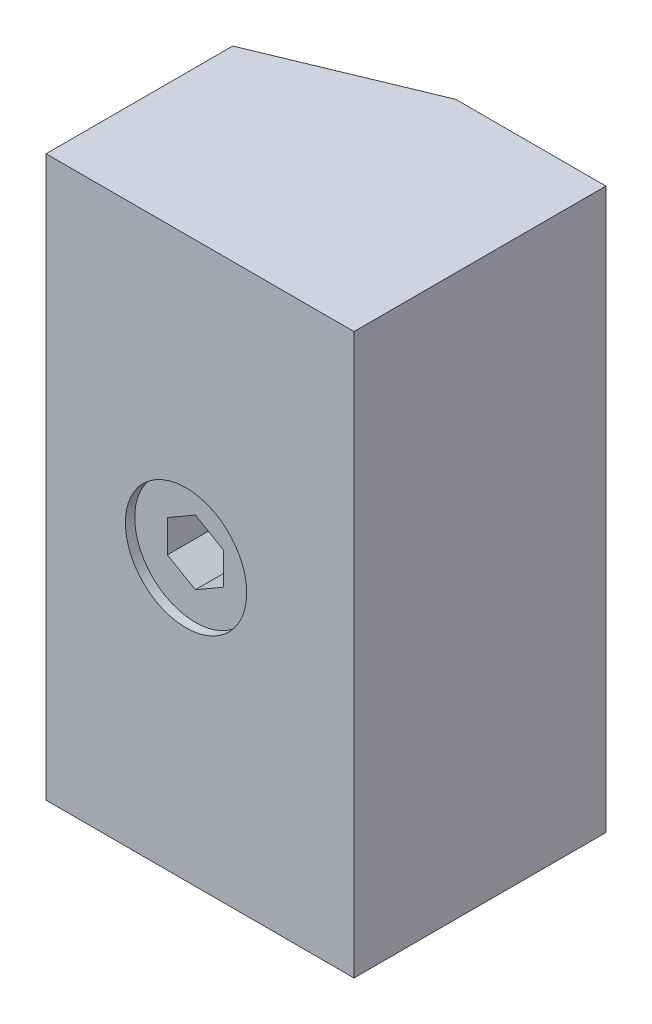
ISO-10303-21;
HEADER;
FILE_DESCRIPTION(('STEP AP214'),'2;1');
FILE_NAME('part.step','',(''),(''),'','','');
FILE_SCHEMA(('AUTOMOTIVE_DESIGN { 1 0 10303 214 1 1 1 1 }'));
ENDSEC;
DATA;
#1=APPLICATION_CONTEXT('core data for automotive mechanical design processes');
#2=APPLICATION_PROTOCOL_DEFINITION('international standard','automotive_design',2000,#1);
#3=PRODUCT_CONTEXT('',#1,'mechanical');
#4=PRODUCT('Part','Part','',(#3));
#5=PRODUCT_RELATED_PRODUCT_CATEGORY('part','',(#4));
#6=PRODUCT_DEFINITION_FORMATION('','',#4);
#7=PRODUCT_DEFINITION_CONTEXT('part definition',#1,'design');
#8=PRODUCT_DEFINITION('design','',#6,#7);
#9=PRODUCT_DEFINITION_SHAPE('','',#8);
#10=(LENGTH_UNIT() NAMED_UNIT(*) SI_UNIT(.MILLI.,.METRE.));
#11=(NAMED_UNIT(*) PLANE_ANGLE_UNIT() SI_UNIT($,.RADIAN.));
#12=(NAMED_UNIT(*) SI_UNIT($,.STERADIAN.) SOLID_ANGLE_UNIT());
#13=UNCERTAINTY_MEASURE_WITH_UNIT(LENGTH_MEASURE(1.E-05),#10,'distance_accuracy_value','');
#14=(GEOMETRIC_REPRESENTATION_CONTEXT(3) GLOBAL_UNCERTAINTY_ASSIGNED_CONTEXT((#13)) GLOBAL_UNIT_ASSIGNED_CONTEXT((#10,
#11,#12)) REPRESENTATION_CONTEXT('',''));
#15=CARTESIAN_POINT('',(0.,0.,0.));
#16=DIRECTION('',(0.,0.,1.));
#17=DIRECTION('',(1.,0.,0.));
#18=AXIS2_PLACEMENT_3D('',#15,#16,#17);
#19=CARTESIAN_POINT('',(-33.,-72.6380112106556,27.));
#20=DIRECTION('',(-1.,0.,0.));
#21=DIRECTION('',(0.,-1.,0.));
#22=AXIS2_PLACEMENT_3D('',#19,#20,#21);
#23=PLANE('',#22);
#24=DIRECTION('',(0.,0.,-1.));
#25=VECTOR('',#24,1.);
#26=CARTESIAN_POINT('',(-33.,-30.,27.));
#27=LINE('',#26,#25);
#28=CARTESIAN_POINT('',(-33.,-30.,27.));
#29=VERTEX_POINT('',#28);
#30=CARTESIAN_POINT('',(-33.,-30.,7.));
#31=VERTEX_POINT('',#30);
#32=EDGE_CURVE('E46',#29,#31,#27,.T.);
#33=ORIENTED_EDGE('',*,*,#32,.F.);
#34=DIRECTION('',(0.,1.,0.));
#35=VECTOR('',#34,1.);
#36=CARTESIAN_POINT('',(-33.,-72.6380112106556,27.));
#37=LINE('',#36,#35);
#38=CARTESIAN_POINT('',(-33.,30.,27.));
#39=VERTEX_POINT('',#38);
#40=EDGE_CURVE('E185',#29,#39,#37,.T.);
#41=ORIENTED_EDGE('',*,*,#40,.T.);
#42=DIRECTION('',(0.,0.,1.));
#43=VECTOR('',#42,1.);
#44=CARTESIAN_POINT('',(-33.,30.,27.));
#45=LINE('',#44,#43);
#46=CARTESIAN_POINT('',(-33.,30.,7.));
#47=VERTEX_POINT('',#46);
#48=EDGE_CURVE('E164',#47,#39,#45,.T.);
#49=ORIENTED_EDGE('',*,*,#48,.F.);
#50=DIRECTION('',(0.,1.,0.));
#51=VECTOR('',#50,1.);
#52=CARTESIAN_POINT('',(-33.,-72.6380112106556,7.));
#53=LINE('',#52,#51);
#54=EDGE_CURVE('E57',#31,#47,#53,.T.);
#55=ORIENTED_EDGE('',*,*,#54,.F.);
#56=EDGE_LOOP('',(#33,#41,#49,#55));
#57=FACE_BOUND('',#56,.T.);
#58=ADVANCED_FACE('F14',(#57),#23,.T.);
#59=CARTESIAN_POINT('',(-33.,-72.6380112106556,7.));
#60=DIRECTION('',(-0.382683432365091,0.,-0.923879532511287));
#61=DIRECTION('',(-0.923879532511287,0.,0.382683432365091));
#62=AXIS2_PLACEMENT_3D('',#59,#60,#61);
#63=PLANE('',#62);
#64=DIRECTION('',(0.923879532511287,0.,-0.382683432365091));
#65=VECTOR('',#64,1.);
#66=CARTESIAN_POINT('',(-33.,-30.,7.));
#67=LINE('',#66,#65);
#68=CARTESIAN_POINT('',(-16.1005050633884,-30.,0.));
#69=VERTEX_POINT('',#68);
#70=EDGE_CURVE('E168',#31,#69,#67,.T.);
#71=ORIENTED_EDGE('',*,*,#70,.F.);
#72=ORIENTED_EDGE('',*,*,#54,.T.);
#73=DIRECTION('',(-0.923879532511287,0.,0.382683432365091));
#74=VECTOR('',#73,1.);
#75=CARTESIAN_POINT('',(-33.,30.,7.));
#76=LINE('',#75,#74);
#77=CARTESIAN_POINT('',(-16.1005050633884,30.,0.));
#78=VERTEX_POINT('',#77);
#79=EDGE_CURVE('E182',#78,#47,#76,.T.);
#80=ORIENTED_EDGE('',*,*,#79,.F.);
#81=DIRECTION('',(0.,1.,0.));
#82=VECTOR('',#81,1.);
#83=CARTESIAN_POINT('',(-16.1005050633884,-72.6380112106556,0.));
#84=LINE('',#83,#82);
#85=EDGE_CURVE('E187',#69,#78,#84,.T.);
#86=ORIENTED_EDGE('',*,*,#85,.F.);
#87=EDGE_LOOP('',(#71,#72,#80,#86));
#88=FACE_BOUND('',#87,.T.);
#89=ADVANCED_FACE('F203',(#88),#63,.T.);
#90=CARTESIAN_POINT('',(0.,-72.6380112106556,0.));
#91=DIRECTION('',(0.,0.,-1.));
#92=DIRECTION('',(-1.,0.,0.));
#93=AXIS2_PLACEMENT_3D('',#90,#91,#92);
#94=PLANE('',#93);
#95=DIRECTION('',(1.,0.,0.));
#96=VECTOR('',#95,1.);
#97=CARTESIAN_POINT('',(0.,-30.,0.));
#98=LINE('',#97,#96);
#99=CARTESIAN_POINT('',(0.,-30.,0.));
#100=VERTEX_POINT('',#99);
#101=EDGE_CURVE('E166',#69,#100,#98,.T.);
#102=ORIENTED_EDGE('',*,*,#101,.F.);
#103=ORIENTED_EDGE('',*,*,#85,.T.);
#104=DIRECTION('',(-1.,0.,0.));
#105=VECTOR('',#104,1.);
#106=CARTESIAN_POINT('',(0.,30.,0.));
#107=LINE('',#106,#105);
#108=CARTESIAN_POINT('',(0.,30.,0.));
#109=VERTEX_POINT('',#108);
#110=EDGE_CURVE('E179',#109,#78,#107,.T.);
#111=ORIENTED_EDGE('',*,*,#110,.F.);
#112=DIRECTION('',(0.,1.,0.));
#113=VECTOR('',#112,1.);
#114=CARTESIAN_POINT('',(0.,-72.6380112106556,0.));
#115=LINE('',#114,#113);
#116=EDGE_CURVE('E189',#100,#109,#115,.T.);
#117=ORIENTED_EDGE('',*,*,#116,.F.);
#118=EDGE_LOOP('',(#102,#103,#111,#117));
#119=FACE_BOUND('',#118,.T.);
#120=ADVANCED_FACE('F206',(#119),#94,.T.);
#121=CARTESIAN_POINT('',(0.,-72.6380112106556,27.));
#122=DIRECTION('',(1.,0.,0.));
#123=DIRECTION('',(0.,1.,0.));
#124=AXIS2_PLACEMENT_3D('',#121,#122,#123);
#125=PLANE('',#124);
#126=DIRECTION('',(0.,0.,1.));
#127=VECTOR('',#126,1.);
#128=CARTESIAN_POINT('',(0.,-30.,27.));
#129=LINE('',#128,#127);
#130=CARTESIAN_POINT('',(0.,-30.,27.));
#131=VERTEX_POINT('',#130);
#132=EDGE_CURVE('E50',#100,#131,#129,.T.);
#133=ORIENTED_EDGE('',*,*,#132,.F.);
#134=ORIENTED_EDGE('',*,*,#116,.T.);
#135=DIRECTION('',(0.,0.,-1.));
#136=VECTOR('',#135,1.);
#137=CARTESIAN_POINT('',(0.,30.,27.));
#138=LINE('',#137,#136);
#139=CARTESIAN_POINT('',(0.,30.,27.));
#140=VERTEX_POINT('',#139);
#141=EDGE_CURVE('E176',#140,#109,#138,.T.);
#142=ORIENTED_EDGE('',*,*,#141,.F.);
#143=DIRECTION('',(0.,1.,0.));
#144=VECTOR('',#143,1.);
#145=CARTESIAN_POINT('',(0.,-72.6380112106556,27.));
#146=LINE('',#145,#144);
#147=EDGE_CURVE('E191',#131,#140,#146,.T.);
#148=ORIENTED_EDGE('',*,*,#147,.F.);
#149=EDGE_LOOP('',(#133,#134,#142,#148));
#150=FACE_BOUND('',#149,.T.);
#151=ADVANCED_FACE('F210',(#150),#125,.T.);
#152=CARTESIAN_POINT('',(-33.,-72.6380112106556,27.));
#153=DIRECTION('',(0.,0.,1.));
#154=DIRECTION('',(1.,0.,0.));
#155=AXIS2_PLACEMENT_3D('',#152,#153,#154);
#156=PLANE('',#155);
#157=CARTESIAN_POINT('',(-18.,0.,27.));
#158=DIRECTION('',(0.,0.,1.));
#159=DIRECTION('',(1.,0.,0.));
#160=AXIS2_PLACEMENT_3D('',#157,#158,#159);
#161=CIRCLE('',#160,6.5);
#162=CARTESIAN_POINT('',(-11.5,0.,27.));
#163=VERTEX_POINT('',#162);
#164=EDGE_CURVE('E140',#163,#163,#161,.T.);
#165=ORIENTED_EDGE('',*,*,#164,.F.);
#166=EDGE_LOOP('',(#165));
#167=FACE_BOUND('',#166,.T.);
#168=DIRECTION('',(-1.,0.,0.));
#169=VECTOR('',#168,1.);
#170=CARTESIAN_POINT('',(-33.,-30.,27.));
#171=LINE('',#170,#169);
#172=EDGE_CURVE('E21',#131,#29,#171,.T.);
#173=ORIENTED_EDGE('',*,*,#172,.F.);
#174=ORIENTED_EDGE('',*,*,#147,.T.);
#175=DIRECTION('',(1.,0.,0.));
#176=VECTOR('',#175,1.);
#177=CARTESIAN_POINT('',(-33.,30.,27.));
#178=LINE('',#177,#176);
#179=EDGE_CURVE('E173',#39,#140,#178,.T.);
#180=ORIENTED_EDGE('',*,*,#179,.F.);
#181=ORIENTED_EDGE('',*,*,#40,.F.);
#182=EDGE_LOOP('',(#173,#174,#180,#181));
#183=FACE_BOUND('',#182,.T.);
#184=ADVANCED_FACE('F197',(#167,#183),#156,.T.);
#185=CARTESIAN_POINT('',(-33.,30.,27.));
#186=DIRECTION('',(0.,-1.,0.));
#187=DIRECTION('',(1.,0.,0.));
#188=AXIS2_PLACEMENT_3D('',#185,#186,#187);
#189=PLANE('',#188);
#190=ORIENTED_EDGE('',*,*,#48,.T.);
#191=ORIENTED_EDGE('',*,*,#179,.T.);
#192=ORIENTED_EDGE('',*,*,#141,.T.);
#193=ORIENTED_EDGE('',*,*,#110,.T.);
#194=ORIENTED_EDGE('',*,*,#79,.T.);
#195=EDGE_LOOP('',(#190,#191,#192,#193,#194));
#196=FACE_BOUND('',#195,.T.);
#197=ADVANCED_FACE('F200',(#196),#189,.F.);
#198=CARTESIAN_POINT('',(-2.,-30.,-13.));
#199=DIRECTION('',(0.,1.,0.));
#200=DIRECTION('',(-1.,0.,0.));
#201=AXIS2_PLACEMENT_3D('',#198,#199,#200);
#202=PLANE('',#201);
#203=ORIENTED_EDGE('',*,*,#32,.T.);
#204=ORIENTED_EDGE('',*,*,#70,.T.);
#205=ORIENTED_EDGE('',*,*,#101,.T.);
#206=ORIENTED_EDGE('',*,*,#132,.T.);
#207=ORIENTED_EDGE('',*,*,#172,.T.);
#208=EDGE_LOOP('',(#203,#204,#205,#206,#207));
#209=FACE_BOUND('',#208,.T.);
#210=ADVANCED_FACE('F208',(#209),#202,.F.);
#211=CARTESIAN_POINT('',(-18.,0.,26.));
#212=DIRECTION('',(0.,0.,1.));
#213=DIRECTION('',(1.,0.,0.));
#214=AXIS2_PLACEMENT_3D('',#211,#212,#213);
#215=CYLINDRICAL_SURFACE('',#214,6.5);
#216=CARTESIAN_POINT('',(-18.,0.,26.));
#217=DIRECTION('',(0.,0.,1.));
#218=DIRECTION('',(1.,0.,0.));
#219=AXIS2_PLACEMENT_3D('',#216,#217,#218);
#220=CIRCLE('',#219,6.5);
#221=CARTESIAN_POINT('',(-11.5,0.,26.));
#222=VERTEX_POINT('',#221);
#223=EDGE_CURVE('E141',#222,#222,#220,.T.);
#224=ORIENTED_EDGE('',*,*,#223,.F.);
#225=EDGE_LOOP('',(#224));
#226=FACE_BOUND('',#225,.T.);
#227=ORIENTED_EDGE('',*,*,#164,.T.);
#228=EDGE_LOOP('',(#227));
#229=FACE_BOUND('',#228,.T.);
#230=ADVANCED_FACE('F235',(#226,#229),#215,.F.);
#231=CARTESIAN_POINT('',(-18.,0.,26.));
#232=DIRECTION('',(0.,0.,1.));
#233=DIRECTION('',(1.,0.,0.));
#234=AXIS2_PLACEMENT_3D('',#231,#232,#233);
#235=PLANE('',#234);
#236=DIRECTION('',(-0.866025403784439,-0.5,0.));
#237=VECTOR('',#236,1.);
#238=CARTESIAN_POINT('',(-18.,3.46410161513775,26.));
#239=LINE('',#238,#237);
#240=CARTESIAN_POINT('',(-18.,3.46410161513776,26.));
#241=VERTEX_POINT('',#240);
#242=CARTESIAN_POINT('',(-21.,1.73205080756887,26.));
#243=VERTEX_POINT('',#242);
#244=EDGE_CURVE('E112',#241,#243,#239,.T.);
#245=ORIENTED_EDGE('',*,*,#244,.F.);
#246=DIRECTION('',(-0.866025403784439,0.5,0.));
#247=VECTOR('',#246,1.);
#248=CARTESIAN_POINT('',(-15.,1.73205080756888,26.));
#249=LINE('',#248,#247);
#250=CARTESIAN_POINT('',(-15.,1.73205080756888,26.));
#251=VERTEX_POINT('',#250);
#252=EDGE_CURVE('E150',#251,#241,#249,.T.);
#253=ORIENTED_EDGE('',*,*,#252,.F.);
#254=DIRECTION('',(0.,1.,0.));
#255=VECTOR('',#254,1.);
#256=CARTESIAN_POINT('',(-15.,-1.73205080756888,26.));
#257=LINE('',#256,#255);
#258=CARTESIAN_POINT('',(-15.,-1.73205080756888,26.));
#259=VERTEX_POINT('',#258);
#260=EDGE_CURVE('E147',#259,#251,#257,.T.);
#261=ORIENTED_EDGE('',*,*,#260,.F.);
#262=DIRECTION('',(0.866025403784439,0.5,0.));
#263=VECTOR('',#262,1.);
#264=CARTESIAN_POINT('',(-18.,-3.46410161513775,26.));
#265=LINE('',#264,#263);
#266=CARTESIAN_POINT('',(-18.,-3.46410161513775,26.));
#267=VERTEX_POINT('',#266);
#268=EDGE_CURVE('E28',#267,#259,#265,.T.);
#269=ORIENTED_EDGE('',*,*,#268,.F.);
#270=DIRECTION('',(0.866025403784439,-0.5,0.));
#271=VECTOR('',#270,1.);
#272=CARTESIAN_POINT('',(-21.,-1.73205080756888,26.));
#273=LINE('',#272,#271);
#274=CARTESIAN_POINT('',(-21.,-1.73205080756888,26.));
#275=VERTEX_POINT('',#274);
#276=EDGE_CURVE('E9',#275,#267,#273,.T.);
#277=ORIENTED_EDGE('',*,*,#276,.F.);
#278=DIRECTION('',(0.,-1.,0.));
#279=VECTOR('',#278,1.);
#280=CARTESIAN_POINT('',(-21.,1.73205080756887,26.));
#281=LINE('',#280,#279);
#282=EDGE_CURVE('E154',#243,#275,#281,.T.);
#283=ORIENTED_EDGE('',*,*,#282,.F.);
#284=EDGE_LOOP('',(#245,#253,#261,#269,#277,#283));
#285=FACE_BOUND('',#284,.T.);
#286=ORIENTED_EDGE('',*,*,#223,.T.);
#287=EDGE_LOOP('',(#286));
#288=FACE_BOUND('',#287,.T.);
#289=ADVANCED_FACE('F240',(#285,#288),#235,.T.);
#290=CARTESIAN_POINT('',(-21.,-1.73205080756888,45.9694030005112));
#291=DIRECTION('',(0.5,0.866025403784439,0.));
#292=DIRECTION('',(-0.866025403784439,0.5,0.));
#293=AXIS2_PLACEMENT_3D('',#290,#291,#292);
#294=PLANE('',#293);
#295=DIRECTION('',(0.,0.,-1.));
#296=VECTOR('',#295,1.);
#297=CARTESIAN_POINT('',(-21.,-1.73205080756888,45.9694030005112));
#298=LINE('',#297,#296);
#299=CARTESIAN_POINT('',(-21.,-1.73205080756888,20.4));
#300=VERTEX_POINT('',#299);
#301=EDGE_CURVE('E116',#275,#300,#298,.T.);
#302=ORIENTED_EDGE('',*,*,#301,.F.);
#303=ORIENTED_EDGE('',*,*,#276,.T.);
#304=DIRECTION('',(0.,0.,-1.));
#305=VECTOR('',#304,1.);
#306=CARTESIAN_POINT('',(-18.,-3.46410161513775,45.9694030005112));
#307=LINE('',#306,#305);
#308=CARTESIAN_POINT('',(-18.,-3.46410161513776,20.4));
#309=VERTEX_POINT('',#308);
#310=EDGE_CURVE('E162',#267,#309,#307,.T.);
#311=ORIENTED_EDGE('',*,*,#310,.T.);
#312=DIRECTION('',(0.866025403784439,-0.5,0.));
#313=VECTOR('',#312,1.);
#314=CARTESIAN_POINT('',(-21.,-1.73205080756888,20.4));
#315=LINE('',#314,#313);
#316=EDGE_CURVE('E125',#300,#309,#315,.T.);
#317=ORIENTED_EDGE('',*,*,#316,.F.);
#318=EDGE_LOOP('',(#302,#303,#311,#317));
#319=FACE_BOUND('',#318,.T.);
#320=ADVANCED_FACE('F236',(#319),#294,.T.);
#321=CARTESIAN_POINT('',(-18.,-3.46410161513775,45.9694030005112));
#322=DIRECTION('',(-0.5,0.866025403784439,0.));
#323=DIRECTION('',(-0.866025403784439,-0.5,0.));
#324=AXIS2_PLACEMENT_3D('',#321,#322,#323);
#325=PLANE('',#324);
#326=ORIENTED_EDGE('',*,*,#310,.F.);
#327=ORIENTED_EDGE('',*,*,#268,.T.);
#328=DIRECTION('',(0.,0.,-1.));
#329=VECTOR('',#328,1.);
#330=CARTESIAN_POINT('',(-15.,-1.73205080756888,45.9694030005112));
#331=LINE('',#330,#329);
#332=CARTESIAN_POINT('',(-15.,-1.73205080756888,20.4));
#333=VERTEX_POINT('',#332);
#334=EDGE_CURVE('E160',#259,#333,#331,.T.);
#335=ORIENTED_EDGE('',*,*,#334,.T.);
#336=DIRECTION('',(0.866025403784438,0.5,0.));
#337=VECTOR('',#336,1.);
#338=CARTESIAN_POINT('',(-18.,-3.46410161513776,20.4));
#339=LINE('',#338,#337);
#340=EDGE_CURVE('E134',#309,#333,#339,.T.);
#341=ORIENTED_EDGE('',*,*,#340,.F.);
#342=EDGE_LOOP('',(#326,#327,#335,#341));
#343=FACE_BOUND('',#342,.T.);
#344=ADVANCED_FACE('F239',(#343),#325,.T.);
#345=CARTESIAN_POINT('',(-15.,-1.73205080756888,45.9694030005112));
#346=DIRECTION('',(-1.,0.,0.));
#347=DIRECTION('',(0.,0.,1.));
#348=AXIS2_PLACEMENT_3D('',#345,#346,#347);
#349=PLANE('',#348);
#350=ORIENTED_EDGE('',*,*,#334,.F.);
#351=ORIENTED_EDGE('',*,*,#260,.T.);
#352=DIRECTION('',(0.,0.,-1.));
#353=VECTOR('',#352,1.);
#354=CARTESIAN_POINT('',(-15.,1.73205080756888,45.9694030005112));
#355=LINE('',#354,#353);
#356=CARTESIAN_POINT('',(-15.,1.73205080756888,20.4));
#357=VERTEX_POINT('',#356);
#358=EDGE_CURVE('E158',#251,#357,#355,.T.);
#359=ORIENTED_EDGE('',*,*,#358,.T.);
#360=DIRECTION('',(0.,1.,0.));
#361=VECTOR('',#360,1.);
#362=CARTESIAN_POINT('',(-15.,-1.73205080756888,20.4));
#363=LINE('',#362,#361);
#364=EDGE_CURVE('E137',#333,#357,#363,.T.);
#365=ORIENTED_EDGE('',*,*,#364,.F.);
#366=EDGE_LOOP('',(#350,#351,#359,#365));
#367=FACE_BOUND('',#366,.T.);
#368=ADVANCED_FACE('F244',(#367),#349,.T.);
#369=CARTESIAN_POINT('',(-15.,1.73205080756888,45.9694030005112));
#370=DIRECTION('',(-0.5,-0.866025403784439,0.));
#371=DIRECTION('',(0.866025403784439,-0.5,0.));
#372=AXIS2_PLACEMENT_3D('',#369,#370,#371);
#373=PLANE('',#372);
#374=ORIENTED_EDGE('',*,*,#358,.F.);
#375=ORIENTED_EDGE('',*,*,#252,.T.);
#376=DIRECTION('',(0.,0.,-1.));
#377=VECTOR('',#376,1.);
#378=CARTESIAN_POINT('',(-18.,3.46410161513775,45.9694030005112));
#379=LINE('',#378,#377);
#380=CARTESIAN_POINT('',(-18.,3.46410161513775,20.4));
#381=VERTEX_POINT('',#380);
#382=EDGE_CURVE('E115',#241,#381,#379,.T.);
#383=ORIENTED_EDGE('',*,*,#382,.T.);
#384=DIRECTION('',(-0.866025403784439,0.5,0.));
#385=VECTOR('',#384,1.);
#386=CARTESIAN_POINT('',(-15.,1.73205080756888,20.4));
#387=LINE('',#386,#385);
#388=EDGE_CURVE('E130',#357,#381,#387,.T.);
#389=ORIENTED_EDGE('',*,*,#388,.F.);
#390=EDGE_LOOP('',(#374,#375,#383,#389));
#391=FACE_BOUND('',#390,.T.);
#392=ADVANCED_FACE('F248',(#391),#373,.T.);
#393=CARTESIAN_POINT('',(-18.,3.46410161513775,45.9694030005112));
#394=DIRECTION('',(0.5,-0.866025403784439,0.));
#395=DIRECTION('',(0.866025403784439,0.5,0.));
#396=AXIS2_PLACEMENT_3D('',#393,#394,#395);
#397=PLANE('',#396);
#398=ORIENTED_EDGE('',*,*,#382,.F.);
#399=ORIENTED_EDGE('',*,*,#244,.T.);
#400=DIRECTION('',(0.,0.,-1.));
#401=VECTOR('',#400,1.);
#402=CARTESIAN_POINT('',(-21.,1.73205080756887,45.9694030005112));
#403=LINE('',#402,#401);
#404=CARTESIAN_POINT('',(-21.,1.73205080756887,20.4));
#405=VERTEX_POINT('',#404);
#406=EDGE_CURVE('E105',#243,#405,#403,.T.);
#407=ORIENTED_EDGE('',*,*,#406,.T.);
#408=DIRECTION('',(-0.866025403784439,-0.5,0.));
#409=VECTOR('',#408,1.);
#410=CARTESIAN_POINT('',(-18.,3.46410161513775,20.4));
#411=LINE('',#410,#409);
#412=EDGE_CURVE('E110',#381,#405,#411,.T.);
#413=ORIENTED_EDGE('',*,*,#412,.F.);
#414=EDGE_LOOP('',(#398,#399,#407,#413));
#415=FACE_BOUND('',#414,.T.);
#416=ADVANCED_FACE('F108',(#415),#397,.T.);
#417=CARTESIAN_POINT('',(-21.,1.73205080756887,45.9694030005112));
#418=DIRECTION('',(1.,0.,0.));
#419=DIRECTION('',(0.,0.,-1.));
#420=AXIS2_PLACEMENT_3D('',#417,#418,#419);
#421=PLANE('',#420);
#422=ORIENTED_EDGE('',*,*,#406,.F.);
#423=ORIENTED_EDGE('',*,*,#282,.T.);
#424=ORIENTED_EDGE('',*,*,#301,.T.);
#425=DIRECTION('',(0.,-1.,0.));
#426=VECTOR('',#425,1.);
#427=CARTESIAN_POINT('',(-21.,1.73205080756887,20.4));
#428=LINE('',#427,#426);
#429=EDGE_CURVE('E119',#405,#300,#428,.T.);
#430=ORIENTED_EDGE('',*,*,#429,.F.);
#431=EDGE_LOOP('',(#422,#423,#424,#430));
#432=FACE_BOUND('',#431,.T.);
#433=ADVANCED_FACE('F120',(#432),#421,.T.);
#434=CARTESIAN_POINT('',(0.,0.,20.4));
#435=DIRECTION('',(0.,0.,1.));
#436=DIRECTION('',(1.,0.,0.));
#437=AXIS2_PLACEMENT_3D('',#434,#435,#436);
#438=PLANE('',#437);
#439=ORIENTED_EDGE('',*,*,#412,.T.);
#440=ORIENTED_EDGE('',*,*,#429,.T.);
#441=ORIENTED_EDGE('',*,*,#316,.T.);
#442=ORIENTED_EDGE('',*,*,#340,.T.);
#443=ORIENTED_EDGE('',*,*,#364,.T.);
#444=ORIENTED_EDGE('',*,*,#388,.T.);
#445=EDGE_LOOP('',(#439,#440,#441,#442,#443,#444));
#446=FACE_BOUND('',#445,.T.);
#447=ADVANCED_FACE('F127',(#446),#438,.T.);
#448=CLOSED_SHELL('',(#58,#89,#120,#151,#184,#197,#210,#230,#289,#320,#344,#368,#392,#416,#433,#447));
#449=MANIFOLD_SOLID_BREP('B1',#448);
#450=ADVANCED_BREP_SHAPE_REPRESENTATION('',(#18,#449),#14);
#451=SHAPE_DEFINITION_REPRESENTATION(#9,#450);
ENDSEC;
END-ISO-10303-21;
